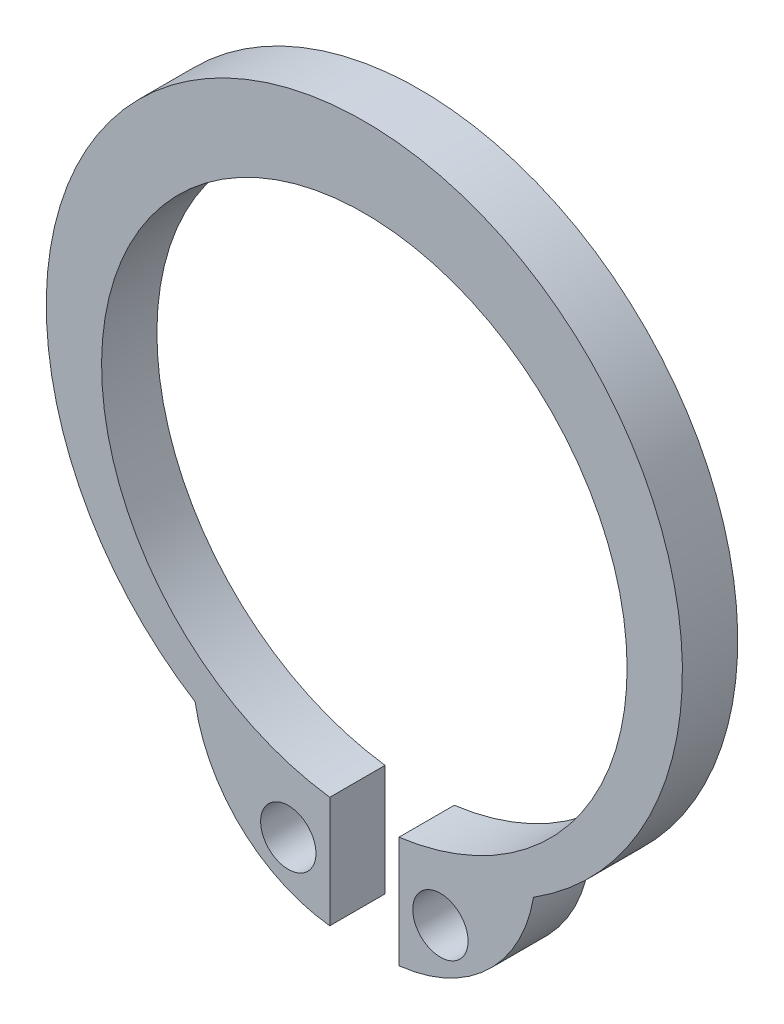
from build123d import *

# Parameters (mm, degrees)
BASE_EXTRUSION_DEPTH    = 0.8
ESQUISSE2_R             = 0.4
ENL_V_MAT_EXTRU_1_DEPTH = 8.121095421


with BuildPart() as part:
    # Esquisse1 → Base-Extrusion (new body)
    with BuildSketch(Plane.XY):
        with BuildLine():
            Line((-0.5, -3.76696164), (-0.5, -5.376802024))
            ThreePointArc((-0.5, -5.376802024), (-1.780976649, -4.787676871), (-2.447175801, -3.54503923))
            ThreePointArc((-2.447175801, -3.54503923), (0, 4.95), (2.447175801, -3.54503923))
            ThreePointArc((2.447175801, -3.54503923), (1.780976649, -4.787676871), (0.5, -5.376802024))
            Line((0.5, -5.376802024), (0.5, -3.76696164))
            ThreePointArc((0.5, -3.76696164), (0, 3.8), (-0.5, -3.76696164))
        make_face()
    extrude(amount=BASE_EXTRUSION_DEPTH)

    # Esquisse2 → Enl_v. mat.-Extru.1 (cut, through all)
    with BuildSketch(Plane.XY.offset(0.8)):
        with Locations((-1.1, -4.569463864)):
            Circle(ESQUISSE2_R)
    enl_v_mat_extru_1 = extrude(amount=-ENL_V_MAT_EXTRU_1_DEPTH, mode=Mode.SUBTRACT)

    # Sym_trie1: Enl_v. mat.-Extru.1 across plane
    add(enl_v_mat_extru_1.mirror(Plane(origin=(0, 0, 0), x_dir=(0, 0, 1), z_dir=(1, 0, 0))), mode=Mode.SUBTRACT)


solid = part.part
